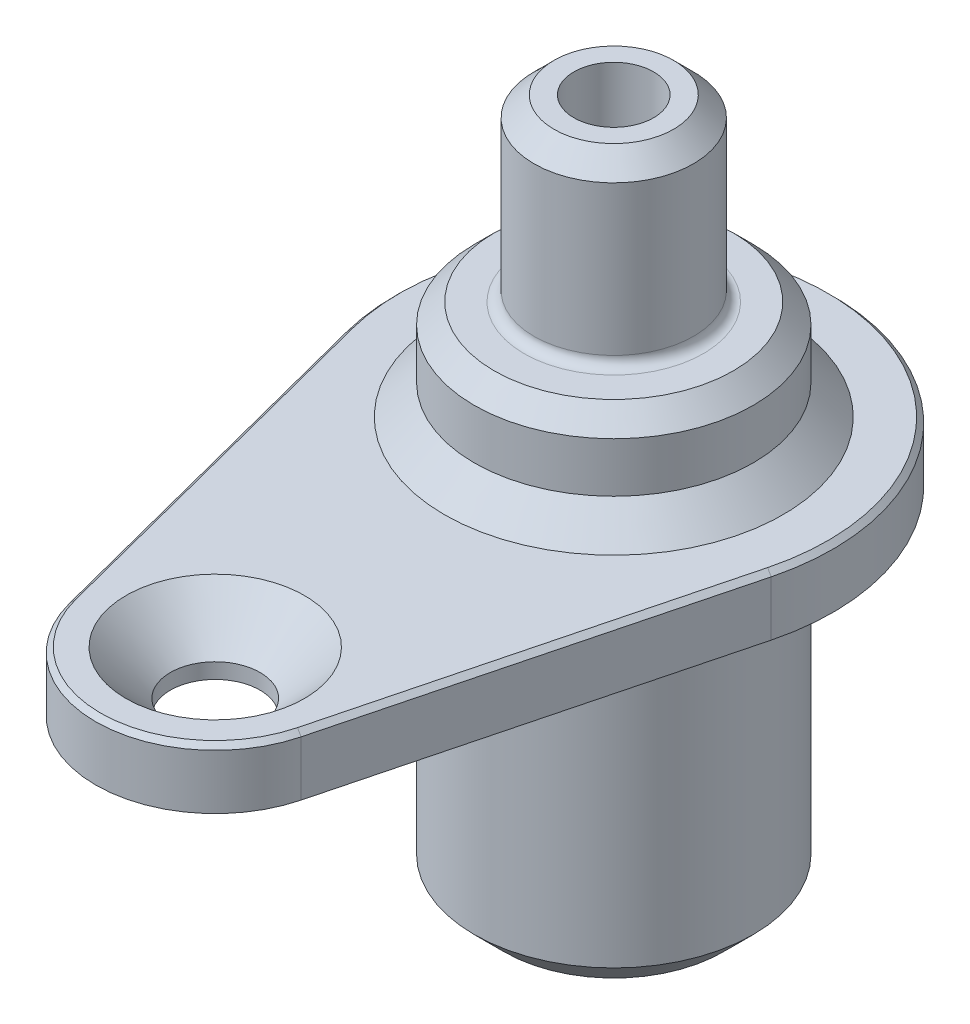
ISO-10303-21;
HEADER;
FILE_DESCRIPTION(('STEP AP214'),'2;1');
FILE_NAME('part.step','',(''),(''),'','','');
FILE_SCHEMA(('AUTOMOTIVE_DESIGN { 1 0 10303 214 1 1 1 1 }'));
ENDSEC;
DATA;
#1=APPLICATION_CONTEXT('core data for automotive mechanical design processes');
#2=APPLICATION_PROTOCOL_DEFINITION('international standard','automotive_design',2000,#1);
#3=PRODUCT_CONTEXT('',#1,'mechanical');
#4=PRODUCT('Part','Part','',(#3));
#5=PRODUCT_RELATED_PRODUCT_CATEGORY('part','',(#4));
#6=PRODUCT_DEFINITION_FORMATION('','',#4);
#7=PRODUCT_DEFINITION_CONTEXT('part definition',#1,'design');
#8=PRODUCT_DEFINITION('design','',#6,#7);
#9=PRODUCT_DEFINITION_SHAPE('','',#8);
#10=(LENGTH_UNIT() NAMED_UNIT(*) SI_UNIT(.MILLI.,.METRE.));
#11=(NAMED_UNIT(*) PLANE_ANGLE_UNIT() SI_UNIT($,.RADIAN.));
#12=(NAMED_UNIT(*) SI_UNIT($,.STERADIAN.) SOLID_ANGLE_UNIT());
#13=UNCERTAINTY_MEASURE_WITH_UNIT(LENGTH_MEASURE(1.E-05),#10,'distance_accuracy_value','');
#14=(GEOMETRIC_REPRESENTATION_CONTEXT(3) GLOBAL_UNCERTAINTY_ASSIGNED_CONTEXT((#13)) GLOBAL_UNIT_ASSIGNED_CONTEXT((#10,
#11,#12)) REPRESENTATION_CONTEXT('',''));
#15=CARTESIAN_POINT('',(0.,0.,0.));
#16=DIRECTION('',(0.,0.,1.));
#17=DIRECTION('',(1.,0.,0.));
#18=AXIS2_PLACEMENT_3D('',#15,#16,#17);
#19=CARTESIAN_POINT('',(0.,-35.0000000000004,0.));
#20=DIRECTION('',(0.,1.00000000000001,0.));
#21=DIRECTION('',(0.,0.,1.00000000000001));
#22=AXIS2_PLACEMENT_3D('',#19,#20,#21);
#23=CYLINDRICAL_SURFACE('',#22,14.);
#24=CARTESIAN_POINT('',(0.,14.,-4.44089209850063E-13));
#25=DIRECTION('',(0.,1.00000000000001,0.));
#26=DIRECTION('',(0.,0.,1.00000000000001));
#27=AXIS2_PLACEMENT_3D('',#24,#25,#26);
#28=CIRCLE('',#27,14.);
#29=CARTESIAN_POINT('',(0.,14.,13.9999999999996));
#30=VERTEX_POINT('',#29);
#31=EDGE_CURVE('E138',#30,#30,#28,.F.);
#32=ORIENTED_EDGE('',*,*,#31,.T.);
#33=EDGE_LOOP('',(#32));
#34=FACE_BOUND('',#33,.T.);
#35=CARTESIAN_POINT('',(0.,9.00000000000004,0.));
#36=DIRECTION('',(0.,1.00000000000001,0.));
#37=DIRECTION('',(0.,0.,1.00000000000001));
#38=AXIS2_PLACEMENT_3D('',#35,#36,#37);
#39=CIRCLE('',#38,14.);
#40=CARTESIAN_POINT('',(0.,9.00000000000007,14.));
#41=VERTEX_POINT('',#40);
#42=EDGE_CURVE('E95',#41,#41,#39,.T.);
#43=ORIENTED_EDGE('',*,*,#42,.T.);
#44=EDGE_LOOP('',(#43));
#45=FACE_BOUND('',#44,.T.);
#46=ADVANCED_FACE('F36',(#34,#45),#23,.T.);
#47=CARTESIAN_POINT('',(0.,34.,0.));
#48=DIRECTION('',(0.,1.00000000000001,0.));
#49=DIRECTION('',(0.,0.,1.00000000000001));
#50=AXIS2_PLACEMENT_3D('',#47,#48,#49);
#51=PLANE('',#50);
#52=CARTESIAN_POINT('',(0.,34.,0.));
#53=DIRECTION('',(0.,1.00000000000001,0.));
#54=DIRECTION('',(0.,0.,1.00000000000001));
#55=AXIS2_PLACEMENT_3D('',#52,#53,#54);
#56=CIRCLE('',#55,5.99999999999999);
#57=CARTESIAN_POINT('',(0.,34.,6.00000000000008));
#58=VERTEX_POINT('',#57);
#59=EDGE_CURVE('E141',#58,#58,#56,.T.);
#60=ORIENTED_EDGE('',*,*,#59,.T.);
#61=EDGE_LOOP('',(#60));
#62=FACE_BOUND('',#61,.T.);
#63=CARTESIAN_POINT('',(0.,34.,0.));
#64=DIRECTION('',(0.,1.00000000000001,0.));
#65=DIRECTION('',(0.,0.,1.00000000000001));
#66=AXIS2_PLACEMENT_3D('',#63,#64,#65);
#67=CIRCLE('',#66,4.);
#68=CARTESIAN_POINT('',(0.,34.,4.00000000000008));
#69=VERTEX_POINT('',#68);
#70=EDGE_CURVE('E183',#69,#69,#67,.T.);
#71=ORIENTED_EDGE('',*,*,#70,.F.);
#72=EDGE_LOOP('',(#71));
#73=FACE_BOUND('',#72,.T.);
#74=ADVANCED_FACE('F226',(#62,#73),#51,.T.);
#75=CARTESIAN_POINT('',(0.,6.00000000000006,40.0000000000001));
#76=DIRECTION('',(0.,-1.00000000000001,0.));
#77=DIRECTION('',(0.,0.,-1.00000000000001));
#78=AXIS2_PLACEMENT_3D('',#75,#76,#77);
#79=CYLINDRICAL_SURFACE('',#78,12.);
#80=DIRECTION('',(0.,-1.00000000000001,0.));
#81=VECTOR('',#80,1.);
#82=CARTESIAN_POINT('',(11.6189500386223,5.99999999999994,43.0000000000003));
#83=LINE('',#82,#81);
#84=CARTESIAN_POINT('',(11.6189500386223,5.49999999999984,43.0000000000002));
#85=VERTEX_POINT('',#84);
#86=CARTESIAN_POINT('',(11.6189500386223,0.,43.0000000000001));
#87=VERTEX_POINT('',#86);
#88=EDGE_CURVE('E87',#85,#87,#83,.T.);
#89=ORIENTED_EDGE('',*,*,#88,.F.);
#90=CARTESIAN_POINT('',(0.,5.50000000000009,40.0000000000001));
#91=DIRECTION('',(0.,1.00000000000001,0.));
#92=DIRECTION('',(0.,0.,1.00000000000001));
#93=AXIS2_PLACEMENT_3D('',#90,#91,#92);
#94=CIRCLE('',#93,12.);
#95=CARTESIAN_POINT('',(-11.6189500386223,5.49999999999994,43.0000000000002));
#96=VERTEX_POINT('',#95);
#97=EDGE_CURVE('E171',#85,#96,#94,.F.);
#98=ORIENTED_EDGE('',*,*,#97,.T.);
#99=DIRECTION('',(0.,-1.00000000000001,0.));
#100=VECTOR('',#99,1.);
#101=CARTESIAN_POINT('',(-11.6189500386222,6.00000000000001,43.0000000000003));
#102=LINE('',#101,#100);
#103=CARTESIAN_POINT('',(-11.6189500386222,3.60822483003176E-13,43.0000000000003));
#104=VERTEX_POINT('',#103);
#105=EDGE_CURVE('E108',#96,#104,#102,.T.);
#106=ORIENTED_EDGE('',*,*,#105,.T.);
#107=CARTESIAN_POINT('',(0.,0.,40.));
#108=DIRECTION('',(0.,1.00000000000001,0.));
#109=DIRECTION('',(0.,0.,1.00000000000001));
#110=AXIS2_PLACEMENT_3D('',#107,#108,#109);
#111=CIRCLE('',#110,12.);
#112=EDGE_CURVE('E102',#104,#87,#111,.T.);
#113=ORIENTED_EDGE('',*,*,#112,.T.);
#114=EDGE_LOOP('',(#89,#98,#106,#113));
#115=FACE_BOUND('',#114,.T.);
#116=ADVANCED_FACE('F106',(#115),#79,.T.);
#117=CARTESIAN_POINT('',(21.3014084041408,6.00000000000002,5.50000000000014));
#118=DIRECTION('',(-0.968245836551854,0.,-0.250000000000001));
#119=DIRECTION('',(-0.25,0.,0.968245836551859));
#120=AXIS2_PLACEMENT_3D('',#117,#118,#119);
#121=PLANE('',#120);
#122=DIRECTION('',(0.,-1.00000000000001,0.));
#123=VECTOR('',#122,1.);
#124=CARTESIAN_POINT('',(21.3014084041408,6.00000000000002,5.50000000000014));
#125=LINE('',#124,#123);
#126=CARTESIAN_POINT('',(21.3014084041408,5.49999999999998,5.49999999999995));
#127=VERTEX_POINT('',#126);
#128=CARTESIAN_POINT('',(21.3014084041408,0.,5.50000000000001));
#129=VERTEX_POINT('',#128);
#130=EDGE_CURVE('E96',#127,#129,#125,.T.);
#131=ORIENTED_EDGE('',*,*,#130,.F.);
#132=DIRECTION('',(-0.25,0.,0.968245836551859));
#133=VECTOR('',#132,1.);
#134=CARTESIAN_POINT('',(11.6189500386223,5.49999999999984,43.0000000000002));
#135=LINE('',#134,#133);
#136=EDGE_CURVE('E11',#127,#85,#135,.T.);
#137=ORIENTED_EDGE('',*,*,#136,.T.);
#138=ORIENTED_EDGE('',*,*,#88,.T.);
#139=DIRECTION('',(0.25,0.,-0.968245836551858));
#140=VECTOR('',#139,1.);
#141=CARTESIAN_POINT('',(21.3014084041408,0.,5.50000000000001));
#142=LINE('',#141,#140);
#143=EDGE_CURVE('E90',#87,#129,#142,.T.);
#144=ORIENTED_EDGE('',*,*,#143,.T.);
#145=EDGE_LOOP('',(#131,#137,#138,#144));
#146=FACE_BOUND('',#145,.T.);
#147=ADVANCED_FACE('F89',(#146),#121,.F.);
#148=CARTESIAN_POINT('',(0.,6.00000000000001,2.22044604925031E-13));
#149=DIRECTION('',(0.,-1.00000000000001,0.));
#150=DIRECTION('',(0.,0.,-1.00000000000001));
#151=AXIS2_PLACEMENT_3D('',#148,#149,#150);
#152=CYLINDRICAL_SURFACE('',#151,22.);
#153=DIRECTION('',(0.,-1.00000000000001,0.));
#154=VECTOR('',#153,1.);
#155=CARTESIAN_POINT('',(-21.3014084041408,5.99999999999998,5.50000000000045));
#156=LINE('',#155,#154);
#157=CARTESIAN_POINT('',(-21.3014084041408,5.50000000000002,5.50000000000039));
#158=VERTEX_POINT('',#157);
#159=CARTESIAN_POINT('',(-21.3014084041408,-2.08166817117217E-13,5.50000000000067));
#160=VERTEX_POINT('',#159);
#161=EDGE_CURVE('E121',#158,#160,#156,.T.);
#162=ORIENTED_EDGE('',*,*,#161,.F.);
#163=CARTESIAN_POINT('',(0.,5.50000000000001,0.));
#164=DIRECTION('',(0.,1.00000000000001,0.));
#165=DIRECTION('',(0.,0.,1.00000000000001));
#166=AXIS2_PLACEMENT_3D('',#163,#164,#165);
#167=CIRCLE('',#166,22.);
#168=EDGE_CURVE('E45',#158,#127,#167,.F.);
#169=ORIENTED_EDGE('',*,*,#168,.T.);
#170=ORIENTED_EDGE('',*,*,#130,.T.);
#171=CARTESIAN_POINT('',(0.,0.,0.));
#172=DIRECTION('',(0.,1.00000000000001,0.));
#173=DIRECTION('',(0.,0.,1.00000000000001));
#174=AXIS2_PLACEMENT_3D('',#171,#172,#173);
#175=CIRCLE('',#174,22.);
#176=EDGE_CURVE('E104',#129,#160,#175,.T.);
#177=ORIENTED_EDGE('',*,*,#176,.T.);
#178=EDGE_LOOP('',(#162,#169,#170,#177));
#179=FACE_BOUND('',#178,.T.);
#180=ADVANCED_FACE('F220',(#179),#152,.T.);
#181=CARTESIAN_POINT('',(-11.6189500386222,6.00000000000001,43.0000000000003));
#182=DIRECTION('',(0.968245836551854,0.,-0.250000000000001));
#183=DIRECTION('',(-0.25,0.,-0.968245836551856));
#184=AXIS2_PLACEMENT_3D('',#181,#182,#183);
#185=PLANE('',#184);
#186=ORIENTED_EDGE('',*,*,#105,.F.);
#187=DIRECTION('',(-0.25,0.,-0.968245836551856));
#188=VECTOR('',#187,1.);
#189=CARTESIAN_POINT('',(-21.3014084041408,5.50000000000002,5.50000000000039));
#190=LINE('',#189,#188);
#191=EDGE_CURVE('E168',#96,#158,#190,.T.);
#192=ORIENTED_EDGE('',*,*,#191,.T.);
#193=ORIENTED_EDGE('',*,*,#161,.T.);
#194=DIRECTION('',(0.25,0.,0.968245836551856));
#195=VECTOR('',#194,1.);
#196=CARTESIAN_POINT('',(-11.6189500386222,3.60822483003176E-13,43.0000000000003));
#197=LINE('',#196,#195);
#198=EDGE_CURVE('E118',#160,#104,#197,.T.);
#199=ORIENTED_EDGE('',*,*,#198,.T.);
#200=EDGE_LOOP('',(#186,#192,#193,#199));
#201=FACE_BOUND('',#200,.T.);
#202=ADVANCED_FACE('F211',(#201),#185,.F.);
#203=CARTESIAN_POINT('',(0.,6.00000000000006,40.0000000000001));
#204=DIRECTION('',(0.,1.00000000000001,0.));
#205=DIRECTION('',(0.,0.,1.00000000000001));
#206=AXIS2_PLACEMENT_3D('',#203,#204,#205);
#207=PLANE('',#206);
#208=CARTESIAN_POINT('',(0.,6.00000000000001,2.22044604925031E-13));
#209=DIRECTION('',(0.,1.00000000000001,0.));
#210=DIRECTION('',(0.,0.,1.00000000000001));
#211=AXIS2_PLACEMENT_3D('',#208,#209,#210);
#212=CIRCLE('',#211,21.5);
#213=CARTESIAN_POINT('',(20.8172854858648,5.99999999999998,5.37499999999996));
#214=VERTEX_POINT('',#213);
#215=CARTESIAN_POINT('',(-20.8172854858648,5.99999999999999,5.37500000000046));
#216=VERTEX_POINT('',#215);
#217=EDGE_CURVE('E161',#214,#216,#212,.T.);
#218=ORIENTED_EDGE('',*,*,#217,.T.);
#219=DIRECTION('',(0.25,0.,0.968245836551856));
#220=VECTOR('',#219,1.);
#221=CARTESIAN_POINT('',(-11.1348271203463,5.99999999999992,42.8750000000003));
#222=LINE('',#221,#220);
#223=CARTESIAN_POINT('',(-11.1348271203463,5.99999999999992,42.8750000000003));
#224=VERTEX_POINT('',#223);
#225=EDGE_CURVE('E165',#216,#224,#222,.T.);
#226=ORIENTED_EDGE('',*,*,#225,.T.);
#227=CARTESIAN_POINT('',(0.,6.00000000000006,40.0000000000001));
#228=DIRECTION('',(0.,1.00000000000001,0.));
#229=DIRECTION('',(0.,0.,1.00000000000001));
#230=AXIS2_PLACEMENT_3D('',#227,#228,#229);
#231=CIRCLE('',#230,11.5);
#232=CARTESIAN_POINT('',(11.1348271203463,5.99999999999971,42.8750000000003));
#233=VERTEX_POINT('',#232);
#234=EDGE_CURVE('E163',#224,#233,#231,.T.);
#235=ORIENTED_EDGE('',*,*,#234,.T.);
#236=DIRECTION('',(0.25,0.,-0.968245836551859));
#237=VECTOR('',#236,1.);
#238=CARTESIAN_POINT('',(20.8172854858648,5.99999999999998,5.37499999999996));
#239=LINE('',#238,#237);
#240=EDGE_CURVE('E159',#233,#214,#239,.T.);
#241=ORIENTED_EDGE('',*,*,#240,.T.);
#242=EDGE_LOOP('',(#218,#226,#235,#241));
#243=FACE_BOUND('',#242,.T.);
#244=CARTESIAN_POINT('',(0.,6.00000000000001,2.22044604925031E-13));
#245=DIRECTION('',(0.,1.00000000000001,0.));
#246=DIRECTION('',(0.,0.,1.00000000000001));
#247=AXIS2_PLACEMENT_3D('',#244,#245,#246);
#248=CIRCLE('',#247,17.);
#249=CARTESIAN_POINT('',(0.,6.00000000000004,17.0000000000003));
#250=VERTEX_POINT('',#249);
#251=EDGE_CURVE('E126',#250,#250,#248,.F.);
#252=ORIENTED_EDGE('',*,*,#251,.T.);
#253=EDGE_LOOP('',(#252));
#254=FACE_BOUND('',#253,.T.);
#255=CARTESIAN_POINT('',(0.,6.00000000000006,40.0000000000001));
#256=DIRECTION('',(0.,1.00000000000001,0.));
#257=DIRECTION('',(0.,0.,1.00000000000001));
#258=AXIS2_PLACEMENT_3D('',#255,#256,#257);
#259=CIRCLE('',#258,8.96);
#260=CARTESIAN_POINT('',(0.,6.00000000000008,48.9600000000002));
#261=VERTEX_POINT('',#260);
#262=EDGE_CURVE('E193',#261,#261,#259,.T.);
#263=ORIENTED_EDGE('',*,*,#262,.F.);
#264=EDGE_LOOP('',(#263));
#265=FACE_BOUND('',#264,.T.);
#266=ADVANCED_FACE('F209',(#243,#254,#265),#207,.T.);
#267=CARTESIAN_POINT('',(0.,0.,40.));
#268=DIRECTION('',(0.,1.00000000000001,0.));
#269=DIRECTION('',(0.,0.,1.00000000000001));
#270=AXIS2_PLACEMENT_3D('',#267,#268,#269);
#271=PLANE('',#270);
#272=CARTESIAN_POINT('',(0.,0.,0.));
#273=DIRECTION('',(0.,1.00000000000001,0.));
#274=DIRECTION('',(0.,0.,1.00000000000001));
#275=AXIS2_PLACEMENT_3D('',#272,#273,#274);
#276=CIRCLE('',#275,15.);
#277=CARTESIAN_POINT('',(0.,0.,15.0000000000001));
#278=VERTEX_POINT('',#277);
#279=EDGE_CURVE('E153',#278,#278,#276,.T.);
#280=ORIENTED_EDGE('',*,*,#279,.T.);
#281=EDGE_LOOP('',(#280));
#282=FACE_BOUND('',#281,.T.);
#283=CARTESIAN_POINT('',(0.,0.,40.));
#284=DIRECTION('',(0.,1.00000000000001,0.));
#285=DIRECTION('',(0.,0.,1.00000000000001));
#286=AXIS2_PLACEMENT_3D('',#283,#284,#285);
#287=CIRCLE('',#286,4.5);
#288=CARTESIAN_POINT('',(0.,0.,44.5000000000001));
#289=VERTEX_POINT('',#288);
#290=EDGE_CURVE('E110',#289,#289,#287,.T.);
#291=ORIENTED_EDGE('',*,*,#290,.T.);
#292=EDGE_LOOP('',(#291));
#293=FACE_BOUND('',#292,.T.);
#294=ORIENTED_EDGE('',*,*,#112,.F.);
#295=ORIENTED_EDGE('',*,*,#198,.F.);
#296=ORIENTED_EDGE('',*,*,#176,.F.);
#297=ORIENTED_EDGE('',*,*,#143,.F.);
#298=EDGE_LOOP('',(#294,#295,#296,#297));
#299=FACE_BOUND('',#298,.T.);
#300=ADVANCED_FACE('F100',(#282,#293,#299),#271,.F.);
#301=CARTESIAN_POINT('',(0.,6.00000000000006,40.0000000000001));
#302=DIRECTION('',(0.,1.00000000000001,0.));
#303=DIRECTION('',(0.,0.,1.00000000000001));
#304=AXIS2_PLACEMENT_3D('',#301,#302,#303);
#305=CYLINDRICAL_SURFACE('',#304,4.5);
#306=ORIENTED_EDGE('',*,*,#290,.F.);
#307=EDGE_LOOP('',(#306));
#308=FACE_BOUND('',#307,.T.);
#309=CARTESIAN_POINT('',(0.,1.53999999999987,40.0000000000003));
#310=DIRECTION('',(0.,1.00000000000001,0.));
#311=DIRECTION('',(0.,0.,1.00000000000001));
#312=AXIS2_PLACEMENT_3D('',#309,#310,#311);
#313=CIRCLE('',#312,4.5);
#314=CARTESIAN_POINT('',(0.,1.53999999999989,44.5000000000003));
#315=VERTEX_POINT('',#314);
#316=EDGE_CURVE('E113',#315,#315,#313,.T.);
#317=ORIENTED_EDGE('',*,*,#316,.T.);
#318=EDGE_LOOP('',(#317));
#319=FACE_BOUND('',#318,.T.);
#320=ADVANCED_FACE('F200',(#308,#319),#305,.F.);
#321=CARTESIAN_POINT('',(0.,6.00000000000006,40.0000000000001));
#322=DIRECTION('',(0.,1.00000000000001,0.));
#323=DIRECTION('',(0.,0.,1.00000000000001));
#324=AXIS2_PLACEMENT_3D('',#321,#322,#323);
#325=CONICAL_SURFACE('',#324,8.96,0.785398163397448);
#326=ORIENTED_EDGE('',*,*,#316,.F.);
#327=EDGE_LOOP('',(#326));
#328=FACE_BOUND('',#327,.T.);
#329=ORIENTED_EDGE('',*,*,#262,.T.);
#330=EDGE_LOOP('',(#329));
#331=FACE_BOUND('',#330,.T.);
#332=ADVANCED_FACE('F202',(#328,#331),#325,.F.);
#333=CARTESIAN_POINT('',(0.,-35.0000000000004,0.));
#334=DIRECTION('',(0.,1.00000000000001,0.));
#335=DIRECTION('',(0.,0.,1.00000000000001));
#336=AXIS2_PLACEMENT_3D('',#333,#334,#335);
#337=PLANE('',#336);
#338=CARTESIAN_POINT('',(0.,-35.0000000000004,0.));
#339=DIRECTION('',(0.,1.00000000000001,0.));
#340=DIRECTION('',(0.,0.,1.00000000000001));
#341=AXIS2_PLACEMENT_3D('',#338,#339,#340);
#342=CIRCLE('',#341,4.);
#343=CARTESIAN_POINT('',(0.,-35.0000000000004,4.0000000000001));
#344=VERTEX_POINT('',#343);
#345=EDGE_CURVE('E188',#344,#344,#342,.T.);
#346=ORIENTED_EDGE('',*,*,#345,.T.);
#347=EDGE_LOOP('',(#346));
#348=FACE_BOUND('',#347,.T.);
#349=CARTESIAN_POINT('',(0.,-35.0000000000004,0.));
#350=DIRECTION('',(0.,1.00000000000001,0.));
#351=DIRECTION('',(0.,0.,1.00000000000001));
#352=AXIS2_PLACEMENT_3D('',#349,#350,#351);
#353=CIRCLE('',#352,11.);
#354=CARTESIAN_POINT('',(0.,-35.0000000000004,11.0000000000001));
#355=VERTEX_POINT('',#354);
#356=EDGE_CURVE('E132',#355,#355,#353,.F.);
#357=ORIENTED_EDGE('',*,*,#356,.T.);
#358=EDGE_LOOP('',(#357));
#359=FACE_BOUND('',#358,.T.);
#360=ADVANCED_FACE('F205',(#348,#359),#337,.F.);
#361=CARTESIAN_POINT('',(0.,-1.,0.));
#362=DIRECTION('',(0.,1.00000000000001,0.));
#363=DIRECTION('',(0.,0.,1.00000000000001));
#364=AXIS2_PLACEMENT_3D('',#361,#362,#363);
#365=CIRCLE('',#364,14.);
#366=CARTESIAN_POINT('',(0.,-0.999999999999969,14.0000000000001));
#367=VERTEX_POINT('',#366);
#368=EDGE_CURVE('E156',#367,#367,#365,.F.);
#369=ORIENTED_EDGE('',*,*,#368,.T.);
#370=EDGE_LOOP('',(#369));
#371=FACE_BOUND('',#370,.T.);
#372=CARTESIAN_POINT('',(0.,-32.0000000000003,-2.4980018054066E-13));
#373=DIRECTION('',(0.,1.00000000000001,0.));
#374=DIRECTION('',(0.,0.,1.00000000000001));
#375=AXIS2_PLACEMENT_3D('',#372,#373,#374);
#376=CIRCLE('',#375,14.);
#377=CARTESIAN_POINT('',(0.,-32.0000000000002,13.9999999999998));
#378=VERTEX_POINT('',#377);
#379=EDGE_CURVE('E129',#378,#378,#376,.T.);
#380=ORIENTED_EDGE('',*,*,#379,.T.);
#381=EDGE_LOOP('',(#380));
#382=FACE_BOUND('',#381,.T.);
#383=ADVANCED_FACE('F229',(#371,#382),#23,.T.);
#384=CARTESIAN_POINT('',(0.,9.00000000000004,0.));
#385=DIRECTION('',(0.,-1.00000000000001,0.));
#386=DIRECTION('',(0.,0.,-1.00000000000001));
#387=AXIS2_PLACEMENT_3D('',#384,#385,#386);
#388=CONICAL_SURFACE('',#387,14.,0.785398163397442);
#389=ORIENTED_EDGE('',*,*,#251,.F.);
#390=EDGE_LOOP('',(#389));
#391=FACE_BOUND('',#390,.T.);
#392=ORIENTED_EDGE('',*,*,#42,.F.);
#393=EDGE_LOOP('',(#392));
#394=FACE_BOUND('',#393,.T.);
#395=ADVANCED_FACE('F238',(#391,#394),#388,.T.);
#396=CARTESIAN_POINT('',(0.,-32.0000000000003,-2.4980018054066E-13));
#397=DIRECTION('',(0.,1.00000000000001,0.));
#398=DIRECTION('',(0.,0.,1.00000000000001));
#399=AXIS2_PLACEMENT_3D('',#396,#397,#398);
#400=CONICAL_SURFACE('',#399,14.,0.78539816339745);
#401=ORIENTED_EDGE('',*,*,#356,.F.);
#402=EDGE_LOOP('',(#401));
#403=FACE_BOUND('',#402,.T.);
#404=ORIENTED_EDGE('',*,*,#379,.F.);
#405=EDGE_LOOP('',(#404));
#406=FACE_BOUND('',#405,.T.);
#407=ADVANCED_FACE('F244',(#403,#406),#400,.T.);
#408=CARTESIAN_POINT('',(0.,-35.0000000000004,0.));
#409=DIRECTION('',(0.,1.00000000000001,0.));
#410=DIRECTION('',(0.,0.,1.00000000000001));
#411=AXIS2_PLACEMENT_3D('',#408,#409,#410);
#412=CYLINDRICAL_SURFACE('',#411,4.);
#413=ORIENTED_EDGE('',*,*,#345,.F.);
#414=EDGE_LOOP('',(#413));
#415=FACE_BOUND('',#414,.T.);
#416=ORIENTED_EDGE('',*,*,#70,.T.);
#417=EDGE_LOOP('',(#416));
#418=FACE_BOUND('',#417,.T.);
#419=ADVANCED_FACE('F253',(#415,#418),#412,.F.);
#420=CARTESIAN_POINT('',(0.,16.0000000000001,0.));
#421=DIRECTION('',(0.,1.00000000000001,0.));
#422=DIRECTION('',(0.,0.,1.00000000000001));
#423=AXIS2_PLACEMENT_3D('',#420,#421,#422);
#424=PLANE('',#423);
#425=CARTESIAN_POINT('',(0.,16.0000000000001,0.));
#426=DIRECTION('',(0.,1.00000000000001,0.));
#427=DIRECTION('',(0.,0.,1.00000000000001));
#428=AXIS2_PLACEMENT_3D('',#425,#426,#427);
#429=CIRCLE('',#428,9.);
#430=CARTESIAN_POINT('',(0.,16.0000000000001,8.99999999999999));
#431=VERTEX_POINT('',#430);
#432=EDGE_CURVE('E150',#431,#431,#429,.F.);
#433=ORIENTED_EDGE('',*,*,#432,.T.);
#434=EDGE_LOOP('',(#433));
#435=FACE_BOUND('',#434,.T.);
#436=CARTESIAN_POINT('',(0.,16.0000000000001,0.));
#437=DIRECTION('',(0.,1.00000000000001,0.));
#438=DIRECTION('',(0.,0.,1.00000000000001));
#439=AXIS2_PLACEMENT_3D('',#436,#437,#438);
#440=CIRCLE('',#439,12.);
#441=CARTESIAN_POINT('',(0.,16.0000000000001,12.));
#442=VERTEX_POINT('',#441);
#443=EDGE_CURVE('E135',#442,#442,#440,.T.);
#444=ORIENTED_EDGE('',*,*,#443,.T.);
#445=EDGE_LOOP('',(#444));
#446=FACE_BOUND('',#445,.T.);
#447=ADVANCED_FACE('F259',(#435,#446),#424,.T.);
#448=CARTESIAN_POINT('',(0.,16.0000000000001,0.));
#449=DIRECTION('',(0.,1.00000000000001,0.));
#450=DIRECTION('',(0.,0.,1.00000000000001));
#451=AXIS2_PLACEMENT_3D('',#448,#449,#450);
#452=CYLINDRICAL_SURFACE('',#451,8.);
#453=CARTESIAN_POINT('',(0.,16.9999999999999,0.));
#454=DIRECTION('',(0.,1.00000000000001,0.));
#455=DIRECTION('',(0.,0.,1.00000000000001));
#456=AXIS2_PLACEMENT_3D('',#453,#454,#455);
#457=CIRCLE('',#456,8.);
#458=CARTESIAN_POINT('',(0.,16.9999999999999,8.00000000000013));
#459=VERTEX_POINT('',#458);
#460=EDGE_CURVE('E147',#459,#459,#457,.T.);
#461=ORIENTED_EDGE('',*,*,#460,.T.);
#462=EDGE_LOOP('',(#461));
#463=FACE_BOUND('',#462,.T.);
#464=CARTESIAN_POINT('',(0.,32.0000000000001,2.22044604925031E-13));
#465=DIRECTION('',(0.,1.00000000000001,0.));
#466=DIRECTION('',(0.,0.,1.00000000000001));
#467=AXIS2_PLACEMENT_3D('',#464,#465,#466);
#468=CIRCLE('',#467,8.);
#469=CARTESIAN_POINT('',(0.,32.0000000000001,8.00000000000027));
#470=VERTEX_POINT('',#469);
#471=EDGE_CURVE('E144',#470,#470,#468,.F.);
#472=ORIENTED_EDGE('',*,*,#471,.T.);
#473=EDGE_LOOP('',(#472));
#474=FACE_BOUND('',#473,.T.);
#475=ADVANCED_FACE('F269',(#463,#474),#452,.T.);
#476=CARTESIAN_POINT('',(0.,16.0000000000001,0.));
#477=DIRECTION('',(0.,-1.00000000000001,0.));
#478=DIRECTION('',(0.,0.,-1.00000000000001));
#479=AXIS2_PLACEMENT_3D('',#476,#477,#478);
#480=CONICAL_SURFACE('',#479,12.,0.785398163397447);
#481=ORIENTED_EDGE('',*,*,#31,.F.);
#482=EDGE_LOOP('',(#481));
#483=FACE_BOUND('',#482,.T.);
#484=ORIENTED_EDGE('',*,*,#443,.F.);
#485=EDGE_LOOP('',(#484));
#486=FACE_BOUND('',#485,.T.);
#487=ADVANCED_FACE('F265',(#483,#486),#480,.T.);
#488=CARTESIAN_POINT('',(0.,34.,0.));
#489=DIRECTION('',(0.,-1.00000000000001,0.));
#490=DIRECTION('',(0.,0.,-1.00000000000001));
#491=AXIS2_PLACEMENT_3D('',#488,#489,#490);
#492=CONICAL_SURFACE('',#491,5.99999999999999,0.785398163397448);
#493=ORIENTED_EDGE('',*,*,#471,.F.);
#494=EDGE_LOOP('',(#493));
#495=FACE_BOUND('',#494,.T.);
#496=ORIENTED_EDGE('',*,*,#59,.F.);
#497=EDGE_LOOP('',(#496));
#498=FACE_BOUND('',#497,.T.);
#499=ADVANCED_FACE('F268',(#495,#498),#492,.T.);
#500=CARTESIAN_POINT('',(0.,16.9999999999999,0.));
#501=DIRECTION('',(0.,1.00000000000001,0.));
#502=DIRECTION('',(0.,0.,1.00000000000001));
#503=AXIS2_PLACEMENT_3D('',#500,#501,#502);
#504=TOROIDAL_SURFACE('',#503,9.,1.);
#505=ORIENTED_EDGE('',*,*,#432,.F.);
#506=EDGE_LOOP('',(#505));
#507=FACE_BOUND('',#506,.T.);
#508=ORIENTED_EDGE('',*,*,#460,.F.);
#509=EDGE_LOOP('',(#508));
#510=FACE_BOUND('',#509,.T.);
#511=ADVANCED_FACE('F273',(#507,#510),#504,.F.);
#512=CARTESIAN_POINT('',(0.,0.,0.));
#513=DIRECTION('',(0.,1.00000000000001,0.));
#514=DIRECTION('',(0.,0.,1.00000000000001));
#515=AXIS2_PLACEMENT_3D('',#512,#513,#514);
#516=CONICAL_SURFACE('',#515,15.,0.785398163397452);
#517=ORIENTED_EDGE('',*,*,#368,.F.);
#518=EDGE_LOOP('',(#517));
#519=FACE_BOUND('',#518,.T.);
#520=ORIENTED_EDGE('',*,*,#279,.F.);
#521=EDGE_LOOP('',(#520));
#522=FACE_BOUND('',#521,.T.);
#523=ADVANCED_FACE('F277',(#519,#522),#516,.T.);
#524=CARTESIAN_POINT('',(11.1348271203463,5.99999999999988,42.8750000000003));
#525=DIRECTION('',(0.684653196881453,0.707106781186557,0.176776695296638));
#526=DIRECTION('',(-0.25,0.,0.968245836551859));
#527=AXIS2_PLACEMENT_3D('',#524,#525,#526);
#528=PLANE('',#527);
#529=DIRECTION('',(-0.68465319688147,0.707106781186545,-0.17677669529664));
#530=VECTOR('',#529,1.);
#531=CARTESIAN_POINT('',(11.6189500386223,5.49999999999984,43.0000000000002));
#532=LINE('',#531,#530);
#533=EDGE_CURVE('E177',#85,#233,#532,.T.);
#534=ORIENTED_EDGE('',*,*,#533,.F.);
#535=ORIENTED_EDGE('',*,*,#136,.F.);
#536=DIRECTION('',(0.684653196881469,-0.707106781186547,0.176776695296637));
#537=VECTOR('',#536,1.);
#538=CARTESIAN_POINT('',(20.8172854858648,5.99999999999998,5.37499999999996));
#539=LINE('',#538,#537);
#540=EDGE_CURVE('E40',#214,#127,#539,.T.);
#541=ORIENTED_EDGE('',*,*,#540,.F.);
#542=ORIENTED_EDGE('',*,*,#240,.F.);
#543=EDGE_LOOP('',(#534,#535,#541,#542));
#544=FACE_BOUND('',#543,.T.);
#545=ADVANCED_FACE('F38',(#544),#528,.T.);
#546=CARTESIAN_POINT('',(0.,6.00000000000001,2.22044604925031E-13));
#547=DIRECTION('',(0.,-1.00000000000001,0.));
#548=DIRECTION('',(0.,0.,-1.00000000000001));
#549=AXIS2_PLACEMENT_3D('',#546,#547,#548);
#550=CONICAL_SURFACE('',#549,21.5,0.785398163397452);
#551=ORIENTED_EDGE('',*,*,#540,.T.);
#552=ORIENTED_EDGE('',*,*,#168,.F.);
#553=DIRECTION('',(-0.684653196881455,-0.707106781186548,0.176776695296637));
#554=VECTOR('',#553,1.);
#555=CARTESIAN_POINT('',(-20.8172854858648,5.99999999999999,5.37500000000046));
#556=LINE('',#555,#554);
#557=EDGE_CURVE('E176',#216,#158,#556,.T.);
#558=ORIENTED_EDGE('',*,*,#557,.F.);
#559=ORIENTED_EDGE('',*,*,#217,.F.);
#560=EDGE_LOOP('',(#551,#552,#558,#559));
#561=FACE_BOUND('',#560,.T.);
#562=ADVANCED_FACE('F288',(#561),#550,.T.);
#563=CARTESIAN_POINT('',(0.,6.00000000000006,40.0000000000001));
#564=DIRECTION('',(0.,-1.00000000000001,0.));
#565=DIRECTION('',(0.,0.,-1.00000000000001));
#566=AXIS2_PLACEMENT_3D('',#563,#564,#565);
#567=CONICAL_SURFACE('',#566,11.5,0.785398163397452);
#568=ORIENTED_EDGE('',*,*,#533,.T.);
#569=ORIENTED_EDGE('',*,*,#234,.F.);
#570=DIRECTION('',(0.684653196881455,0.707106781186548,-0.17677669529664));
#571=VECTOR('',#570,1.);
#572=CARTESIAN_POINT('',(-11.6189500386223,5.49999999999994,43.0000000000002));
#573=LINE('',#572,#571);
#574=EDGE_CURVE('E174',#96,#224,#573,.T.);
#575=ORIENTED_EDGE('',*,*,#574,.F.);
#576=ORIENTED_EDGE('',*,*,#97,.F.);
#577=EDGE_LOOP('',(#568,#569,#575,#576));
#578=FACE_BOUND('',#577,.T.);
#579=ADVANCED_FACE('F285',(#578),#567,.T.);
#580=CARTESIAN_POINT('',(-11.1348271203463,5.99999999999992,42.8750000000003));
#581=DIRECTION('',(-0.684653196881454,0.707106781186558,0.176776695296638));
#582=DIRECTION('',(-0.25,0.,-0.968245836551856));
#583=AXIS2_PLACEMENT_3D('',#580,#581,#582);
#584=PLANE('',#583);
#585=ORIENTED_EDGE('',*,*,#557,.T.);
#586=ORIENTED_EDGE('',*,*,#191,.F.);
#587=ORIENTED_EDGE('',*,*,#574,.T.);
#588=ORIENTED_EDGE('',*,*,#225,.F.);
#589=EDGE_LOOP('',(#585,#586,#587,#588));
#590=FACE_BOUND('',#589,.T.);
#591=ADVANCED_FACE('F282',(#590),#584,.T.);
#592=CLOSED_SHELL('',(#46,#74,#116,#147,#180,#202,#266,#300,#320,#332,#360,#383,#395,#407,#419,
#447,#475,#487,#499,#511,#523,#545,#562,#579,#591));
#593=MANIFOLD_SOLID_BREP('B2',#592);
#594=ADVANCED_BREP_SHAPE_REPRESENTATION('',(#18,#593),#14);
#595=SHAPE_DEFINITION_REPRESENTATION(#9,#594);
ENDSEC;
END-ISO-10303-21;
